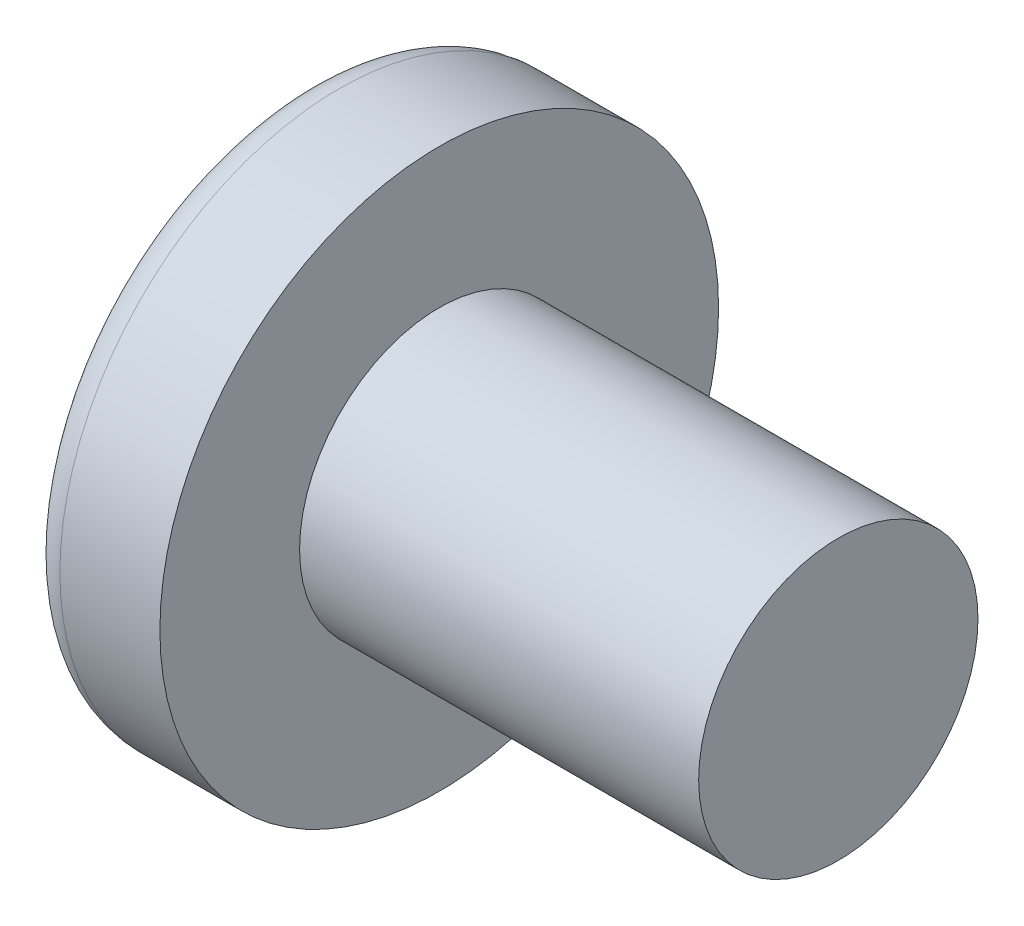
ISO-10303-21;
HEADER;
FILE_DESCRIPTION(('STEP AP214'),'2;1');
FILE_NAME('part.step','',(''),(''),'','','');
FILE_SCHEMA(('AUTOMOTIVE_DESIGN { 1 0 10303 214 1 1 1 1 }'));
ENDSEC;
DATA;
#1=APPLICATION_CONTEXT('core data for automotive mechanical design processes');
#2=APPLICATION_PROTOCOL_DEFINITION('international standard','automotive_design',2000,#1);
#3=PRODUCT_CONTEXT('',#1,'mechanical');
#4=PRODUCT('Part','Part','',(#3));
#5=PRODUCT_RELATED_PRODUCT_CATEGORY('part','',(#4));
#6=PRODUCT_DEFINITION_FORMATION('','',#4);
#7=PRODUCT_DEFINITION_CONTEXT('part definition',#1,'design');
#8=PRODUCT_DEFINITION('design','',#6,#7);
#9=PRODUCT_DEFINITION_SHAPE('','',#8);
#10=(LENGTH_UNIT() NAMED_UNIT(*) SI_UNIT(.MILLI.,.METRE.));
#11=(NAMED_UNIT(*) PLANE_ANGLE_UNIT() SI_UNIT($,.RADIAN.));
#12=(NAMED_UNIT(*) SI_UNIT($,.STERADIAN.) SOLID_ANGLE_UNIT());
#13=UNCERTAINTY_MEASURE_WITH_UNIT(LENGTH_MEASURE(1.E-05),#10,'distance_accuracy_value','');
#14=(GEOMETRIC_REPRESENTATION_CONTEXT(3) GLOBAL_UNCERTAINTY_ASSIGNED_CONTEXT((#13)) GLOBAL_UNIT_ASSIGNED_CONTEXT((#10,
#11,#12)) REPRESENTATION_CONTEXT('',''));
#15=CARTESIAN_POINT('',(0.,0.,0.));
#16=DIRECTION('',(0.,0.,1.));
#17=DIRECTION('',(1.,0.,0.));
#18=AXIS2_PLACEMENT_3D('',#15,#16,#17);
#19=CARTESIAN_POINT('',(6.,0.,0.));
#20=DIRECTION('',(-1.,0.,0.));
#21=DIRECTION('',(0.,1.,0.));
#22=AXIS2_PLACEMENT_3D('',#19,#20,#21);
#23=SPHERICAL_SURFACE('',#22,6.);
#24=CARTESIAN_POINT('',(0.996821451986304,0.,0.));
#25=DIRECTION('',(-1.,0.,0.));
#26=DIRECTION('',(0.,0.,1.));
#27=AXIS2_PLACEMENT_3D('',#24,#25,#26);
#28=CIRCLE('',#27,3.31182795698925);
#29=CARTESIAN_POINT('',(0.996821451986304,0.,3.31182795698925));
#30=VERTEX_POINT('',#29);
#31=EDGE_CURVE('E149',#30,#30,#28,.T.);
#32=ORIENTED_EDGE('',*,*,#31,.T.);
#33=EDGE_LOOP('',(#32));
#34=FACE_BOUND('',#33,.T.);
#35=CARTESIAN_POINT('',(5.97419529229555,-0.231352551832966,0.));
#36=DIRECTION('',(-0.110851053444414,-0.993837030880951,0.));
#37=DIRECTION('',(0.993837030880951,-0.110851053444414,0.));
#38=AXIS2_PLACEMENT_3D('',#35,#36,#37);
#39=CIRCLE('',#38,5.99548247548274);
#40=CARTESIAN_POINT('',(0.266641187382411,0.405259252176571,1.72173216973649));
#41=VERTEX_POINT('',#40);
#42=CARTESIAN_POINT('',(0.0311169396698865,0.431529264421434,0.431529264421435));
#43=VERTEX_POINT('',#42);
#44=EDGE_CURVE('E124',#41,#43,#39,.T.);
#45=ORIENTED_EDGE('',*,*,#44,.F.);
#46=CARTESIAN_POINT('',(4.30993859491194,0.,-1.8913169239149));
#47=DIRECTION('',(0.666319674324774,0.,0.74566620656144));
#48=DIRECTION('',(0.74566620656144,0.,-0.666319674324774));
#49=AXIS2_PLACEMENT_3D('',#46,#47,#48);
#50=CIRCLE('',#49,5.43751898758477);
#51=CARTESIAN_POINT('',(0.266641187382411,-0.405259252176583,1.72173216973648));
#52=VERTEX_POINT('',#51);
#53=EDGE_CURVE('E117',#41,#52,#50,.T.);
#54=ORIENTED_EDGE('',*,*,#53,.T.);
#55=CARTESIAN_POINT('',(5.97419529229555,0.231352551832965,0.));
#56=DIRECTION('',(-0.110851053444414,0.993837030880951,0.));
#57=DIRECTION('',(-0.993837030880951,-0.110851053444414,0.));
#58=AXIS2_PLACEMENT_3D('',#55,#56,#57);
#59=CIRCLE('',#58,5.99548247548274);
#60=CARTESIAN_POINT('',(0.0311169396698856,-0.431529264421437,0.431529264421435));
#61=VERTEX_POINT('',#60);
#62=EDGE_CURVE('E190',#61,#52,#59,.T.);
#63=ORIENTED_EDGE('',*,*,#62,.F.);
#64=CARTESIAN_POINT('',(5.97419529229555,0.,-0.231352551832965));
#65=DIRECTION('',(-0.110851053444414,0.,-0.993837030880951));
#66=DIRECTION('',(-0.993837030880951,0.,0.110851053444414));
#67=AXIS2_PLACEMENT_3D('',#64,#65,#66);
#68=CIRCLE('',#67,5.99548247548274);
#69=CARTESIAN_POINT('',(0.266641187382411,-1.72173216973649,0.405259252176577));
#70=VERTEX_POINT('',#69);
#71=EDGE_CURVE('E165',#70,#61,#68,.T.);
#72=ORIENTED_EDGE('',*,*,#71,.F.);
#73=CARTESIAN_POINT('',(4.30993859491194,1.8913169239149,0.));
#74=DIRECTION('',(0.666319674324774,-0.74566620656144,0.));
#75=DIRECTION('',(0.74566620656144,0.666319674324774,0.));
#76=AXIS2_PLACEMENT_3D('',#73,#74,#75);
#77=CIRCLE('',#76,5.43751898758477);
#78=CARTESIAN_POINT('',(0.266641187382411,-1.72173216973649,-0.405259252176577));
#79=VERTEX_POINT('',#78);
#80=EDGE_CURVE('E161',#70,#79,#77,.T.);
#81=ORIENTED_EDGE('',*,*,#80,.T.);
#82=CARTESIAN_POINT('',(5.97419529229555,0.,0.231352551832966));
#83=DIRECTION('',(-0.110851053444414,0.,0.993837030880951));
#84=DIRECTION('',(0.993837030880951,0.,0.110851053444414));
#85=AXIS2_PLACEMENT_3D('',#82,#83,#84);
#86=CIRCLE('',#85,5.99548247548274);
#87=CARTESIAN_POINT('',(0.0311169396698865,-0.431529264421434,-0.431529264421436));
#88=VERTEX_POINT('',#87);
#89=EDGE_CURVE('E45',#88,#79,#86,.T.);
#90=ORIENTED_EDGE('',*,*,#89,.F.);
#91=CARTESIAN_POINT('',(0.266641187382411,-0.405259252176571,-1.72173216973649));
#92=VERTEX_POINT('',#91);
#93=EDGE_CURVE('E187',#92,#88,#59,.T.);
#94=ORIENTED_EDGE('',*,*,#93,.F.);
#95=CARTESIAN_POINT('',(4.30993859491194,0.,1.8913169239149));
#96=DIRECTION('',(0.666319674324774,0.,-0.74566620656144));
#97=DIRECTION('',(-0.74566620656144,0.,-0.666319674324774));
#98=AXIS2_PLACEMENT_3D('',#95,#96,#97);
#99=CIRCLE('',#98,5.43751898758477);
#100=CARTESIAN_POINT('',(0.266641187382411,0.405259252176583,-1.72173216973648));
#101=VERTEX_POINT('',#100);
#102=EDGE_CURVE('E180',#92,#101,#99,.T.);
#103=ORIENTED_EDGE('',*,*,#102,.T.);
#104=CARTESIAN_POINT('',(0.0311169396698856,0.431529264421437,-0.431529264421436));
#105=VERTEX_POINT('',#104);
#106=EDGE_CURVE('E102',#105,#101,#39,.T.);
#107=ORIENTED_EDGE('',*,*,#106,.F.);
#108=CARTESIAN_POINT('',(0.266641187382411,1.72173216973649,-0.405259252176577));
#109=VERTEX_POINT('',#108);
#110=EDGE_CURVE('E38',#109,#105,#86,.T.);
#111=ORIENTED_EDGE('',*,*,#110,.F.);
#112=CARTESIAN_POINT('',(4.30993859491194,-1.8913169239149,0.));
#113=DIRECTION('',(0.666319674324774,0.74566620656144,0.));
#114=DIRECTION('',(-0.74566620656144,0.666319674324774,0.));
#115=AXIS2_PLACEMENT_3D('',#112,#113,#114);
#116=CIRCLE('',#115,5.43751898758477);
#117=CARTESIAN_POINT('',(0.266641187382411,1.72173216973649,0.405259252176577));
#118=VERTEX_POINT('',#117);
#119=EDGE_CURVE('E11',#109,#118,#116,.T.);
#120=ORIENTED_EDGE('',*,*,#119,.T.);
#121=EDGE_CURVE('E164',#43,#118,#68,.T.);
#122=ORIENTED_EDGE('',*,*,#121,.F.);
#123=EDGE_LOOP('',(#45,#54,#63,#72,#81,#90,#94,#103,#107,#111,#120,#122));
#124=FACE_BOUND('',#123,.T.);
#125=ADVANCED_FACE('F30',(#34,#124),#23,.T.);
#126=CARTESIAN_POINT('',(2.19340028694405,0.,-0.190351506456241));
#127=DIRECTION('',(-0.110851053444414,0.,0.993837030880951));
#128=DIRECTION('',(0.993837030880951,0.,0.110851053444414));
#129=AXIS2_PLACEMENT_3D('',#126,#127,#128);
#130=PLANE('',#129);
#131=ORIENTED_EDGE('',*,*,#110,.T.);
#132=DIRECTION('',(0.987786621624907,-0.110176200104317,0.110176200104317));
#133=VECTOR('',#132,1.);
#134=CARTESIAN_POINT('',(2.21411635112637,0.188040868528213,-0.188040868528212));
#135=LINE('',#134,#133);
#136=CARTESIAN_POINT('',(1.95,0.217500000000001,-0.217499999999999));
#137=VERTEX_POINT('',#136);
#138=EDGE_CURVE('E100',#105,#137,#135,.T.);
#139=ORIENTED_EDGE('',*,*,#138,.T.);
#140=DIRECTION('',(0.743100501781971,-0.664026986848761,0.0828842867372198));
#141=VECTOR('',#140,1.);
#142=CARTESIAN_POINT('',(0.,1.96,-0.435));
#143=LINE('',#142,#141);
#144=EDGE_CURVE('E122',#109,#137,#143,.T.);
#145=ORIENTED_EDGE('',*,*,#144,.F.);
#146=EDGE_LOOP('',(#131,#139,#145));
#147=FACE_BOUND('',#146,.T.);
#148=ADVANCED_FACE('F121',(#147),#130,.T.);
#149=DIRECTION('',(0.743100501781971,0.664026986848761,0.0828842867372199));
#150=VECTOR('',#149,1.);
#151=CARTESIAN_POINT('',(0.,-1.96,-0.435));
#152=LINE('',#151,#150);
#153=CARTESIAN_POINT('',(1.95,-0.2175,-0.2175));
#154=VERTEX_POINT('',#153);
#155=EDGE_CURVE('E143',#79,#154,#152,.T.);
#156=ORIENTED_EDGE('',*,*,#155,.T.);
#157=DIRECTION('',(-0.987786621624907,-0.110176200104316,-0.110176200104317));
#158=VECTOR('',#157,1.);
#159=CARTESIAN_POINT('',(2.21411635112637,-0.188040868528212,-0.188040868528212));
#160=LINE('',#159,#158);
#161=EDGE_CURVE('E188',#154,#88,#160,.T.);
#162=ORIENTED_EDGE('',*,*,#161,.T.);
#163=ORIENTED_EDGE('',*,*,#89,.T.);
#164=EDGE_LOOP('',(#156,#162,#163));
#165=FACE_BOUND('',#164,.T.);
#166=ADVANCED_FACE('F221',(#165),#130,.T.);
#167=CARTESIAN_POINT('',(2.19340028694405,0.,0.190351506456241));
#168=DIRECTION('',(-0.110851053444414,0.,-0.993837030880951));
#169=DIRECTION('',(-0.993837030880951,0.,0.110851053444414));
#170=AXIS2_PLACEMENT_3D('',#167,#168,#169);
#171=PLANE('',#170);
#172=DIRECTION('',(0.743100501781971,-0.664026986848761,-0.0828842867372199));
#173=VECTOR('',#172,1.);
#174=CARTESIAN_POINT('',(0.,1.96,0.435));
#175=LINE('',#174,#173);
#176=CARTESIAN_POINT('',(1.95,0.2175,0.2175));
#177=VERTEX_POINT('',#176);
#178=EDGE_CURVE('E129',#118,#177,#175,.T.);
#179=ORIENTED_EDGE('',*,*,#178,.T.);
#180=DIRECTION('',(-0.987786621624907,0.110176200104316,0.110176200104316));
#181=VECTOR('',#180,1.);
#182=CARTESIAN_POINT('',(2.21411635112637,0.188040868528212,0.188040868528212));
#183=LINE('',#182,#181);
#184=EDGE_CURVE('E176',#177,#43,#183,.T.);
#185=ORIENTED_EDGE('',*,*,#184,.T.);
#186=ORIENTED_EDGE('',*,*,#121,.T.);
#187=EDGE_LOOP('',(#179,#185,#186));
#188=FACE_BOUND('',#187,.T.);
#189=ADVANCED_FACE('F174',(#188),#171,.T.);
#190=ORIENTED_EDGE('',*,*,#71,.T.);
#191=DIRECTION('',(0.987786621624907,0.110176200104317,-0.110176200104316));
#192=VECTOR('',#191,1.);
#193=CARTESIAN_POINT('',(2.21411635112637,-0.188040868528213,0.188040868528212));
#194=LINE('',#193,#192);
#195=CARTESIAN_POINT('',(1.95,-0.217500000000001,0.217499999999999));
#196=VERTEX_POINT('',#195);
#197=EDGE_CURVE('E193',#61,#196,#194,.T.);
#198=ORIENTED_EDGE('',*,*,#197,.T.);
#199=DIRECTION('',(0.743100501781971,0.664026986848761,-0.0828842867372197));
#200=VECTOR('',#199,1.);
#201=CARTESIAN_POINT('',(0.,-1.96,0.434999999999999));
#202=LINE('',#201,#200);
#203=EDGE_CURVE('E140',#70,#196,#202,.T.);
#204=ORIENTED_EDGE('',*,*,#203,.F.);
#205=EDGE_LOOP('',(#190,#198,#204));
#206=FACE_BOUND('',#205,.T.);
#207=ADVANCED_FACE('F240',(#206),#171,.T.);
#208=CARTESIAN_POINT('',(-25.4,0.,0.));
#209=DIRECTION('',(-1.,0.,0.));
#210=DIRECTION('',(0.,0.,1.));
#211=AXIS2_PLACEMENT_3D('',#208,#209,#210);
#212=CYLINDRICAL_SURFACE('',#211,1.75);
#213=CARTESIAN_POINT('',(7.6,0.,0.));
#214=DIRECTION('',(-1.,0.,0.));
#215=DIRECTION('',(0.,0.,1.));
#216=AXIS2_PLACEMENT_3D('',#213,#214,#215);
#217=CIRCLE('',#216,1.75);
#218=CARTESIAN_POINT('',(7.6,0.,1.75));
#219=VERTEX_POINT('',#218);
#220=EDGE_CURVE('E128',#219,#219,#217,.T.);
#221=ORIENTED_EDGE('',*,*,#220,.T.);
#222=EDGE_LOOP('',(#221));
#223=FACE_BOUND('',#222,.T.);
#224=CARTESIAN_POINT('',(2.6,0.,0.));
#225=DIRECTION('',(-1.,0.,0.));
#226=DIRECTION('',(0.,0.,1.));
#227=AXIS2_PLACEMENT_3D('',#224,#225,#226);
#228=CIRCLE('',#227,1.75);
#229=CARTESIAN_POINT('',(2.6,0.,1.75));
#230=VERTEX_POINT('',#229);
#231=EDGE_CURVE('E158',#230,#230,#228,.T.);
#232=ORIENTED_EDGE('',*,*,#231,.F.);
#233=EDGE_LOOP('',(#232));
#234=FACE_BOUND('',#233,.T.);
#235=ADVANCED_FACE('F32',(#223,#234),#212,.T.);
#236=CARTESIAN_POINT('',(2.6,1.75,0.));
#237=DIRECTION('',(-1.,0.,0.));
#238=DIRECTION('',(0.,0.,1.));
#239=AXIS2_PLACEMENT_3D('',#236,#237,#238);
#240=PLANE('',#239);
#241=CARTESIAN_POINT('',(2.6,0.,0.));
#242=DIRECTION('',(-1.,0.,0.));
#243=DIRECTION('',(0.,0.,1.));
#244=AXIS2_PLACEMENT_3D('',#241,#242,#243);
#245=CIRCLE('',#244,3.5);
#246=CARTESIAN_POINT('',(2.6,0.,3.5));
#247=VERTEX_POINT('',#246);
#248=EDGE_CURVE('E155',#247,#247,#245,.T.);
#249=ORIENTED_EDGE('',*,*,#248,.F.);
#250=EDGE_LOOP('',(#249));
#251=FACE_BOUND('',#250,.T.);
#252=ORIENTED_EDGE('',*,*,#231,.T.);
#253=EDGE_LOOP('',(#252));
#254=FACE_BOUND('',#253,.T.);
#255=ADVANCED_FACE('F233',(#251,#254),#240,.F.);
#256=CARTESIAN_POINT('',(-25.4,0.,0.));
#257=DIRECTION('',(-1.,0.,0.));
#258=DIRECTION('',(0.,0.,1.));
#259=AXIS2_PLACEMENT_3D('',#256,#257,#258);
#260=CYLINDRICAL_SURFACE('',#259,3.5);
#261=ORIENTED_EDGE('',*,*,#248,.T.);
#262=EDGE_LOOP('',(#261));
#263=FACE_BOUND('',#262,.T.);
#264=CARTESIAN_POINT('',(1.34704395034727,0.,0.));
#265=DIRECTION('',(-1.,0.,0.));
#266=DIRECTION('',(0.,0.,1.));
#267=AXIS2_PLACEMENT_3D('',#264,#265,#266);
#268=CIRCLE('',#267,3.5);
#269=CARTESIAN_POINT('',(1.34704395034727,0.,3.5));
#270=VERTEX_POINT('',#269);
#271=EDGE_CURVE('E152',#270,#270,#268,.T.);
#272=ORIENTED_EDGE('',*,*,#271,.F.);
#273=EDGE_LOOP('',(#272));
#274=FACE_BOUND('',#273,.T.);
#275=ADVANCED_FACE('F230',(#263,#274),#260,.T.);
#276=CARTESIAN_POINT('',(1.34704395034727,0.,0.));
#277=DIRECTION('',(-1.,0.,0.));
#278=DIRECTION('',(0.,0.,1.));
#279=AXIS2_PLACEMENT_3D('',#276,#277,#278);
#280=TOROIDAL_SURFACE('',#279,3.08,0.42);
#281=ORIENTED_EDGE('',*,*,#271,.T.);
#282=EDGE_LOOP('',(#281));
#283=FACE_BOUND('',#282,.T.);
#284=ORIENTED_EDGE('',*,*,#31,.F.);
#285=EDGE_LOOP('',(#284));
#286=FACE_BOUND('',#285,.T.);
#287=ADVANCED_FACE('F227',(#283,#286),#280,.T.);
#288=CARTESIAN_POINT('',(7.6,1.75,0.));
#289=DIRECTION('',(1.,0.,0.));
#290=DIRECTION('',(0.,0.,-1.));
#291=AXIS2_PLACEMENT_3D('',#288,#289,#290);
#292=PLANE('',#291);
#293=ORIENTED_EDGE('',*,*,#220,.F.);
#294=EDGE_LOOP('',(#293));
#295=FACE_BOUND('',#294,.T.);
#296=ADVANCED_FACE('F225',(#295),#292,.T.);
#297=CARTESIAN_POINT('',(1.95,0.2175,0.2175));
#298=DIRECTION('',(0.666319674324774,0.74566620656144,0.));
#299=DIRECTION('',(-0.74566620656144,0.666319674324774,0.));
#300=AXIS2_PLACEMENT_3D('',#297,#298,#299);
#301=PLANE('',#300);
#302=ORIENTED_EDGE('',*,*,#144,.T.);
#303=DIRECTION('',(0.,0.,-1.));
#304=VECTOR('',#303,1.);
#305=CARTESIAN_POINT('',(1.95,0.2175,0.2175));
#306=LINE('',#305,#304);
#307=EDGE_CURVE('E116',#177,#137,#306,.T.);
#308=ORIENTED_EDGE('',*,*,#307,.F.);
#309=ORIENTED_EDGE('',*,*,#178,.F.);
#310=ORIENTED_EDGE('',*,*,#119,.F.);
#311=EDGE_LOOP('',(#302,#308,#309,#310));
#312=FACE_BOUND('',#311,.T.);
#313=ADVANCED_FACE('F127',(#312),#301,.F.);
#314=CARTESIAN_POINT('',(1.95,-0.2175,-0.2175));
#315=DIRECTION('',(0.666319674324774,-0.74566620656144,0.));
#316=DIRECTION('',(0.74566620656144,0.666319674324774,0.));
#317=AXIS2_PLACEMENT_3D('',#314,#315,#316);
#318=PLANE('',#317);
#319=ORIENTED_EDGE('',*,*,#203,.T.);
#320=DIRECTION('',(0.,0.,1.));
#321=VECTOR('',#320,1.);
#322=CARTESIAN_POINT('',(1.95,-0.2175,-0.2175));
#323=LINE('',#322,#321);
#324=EDGE_CURVE('E136',#154,#196,#323,.T.);
#325=ORIENTED_EDGE('',*,*,#324,.F.);
#326=ORIENTED_EDGE('',*,*,#155,.F.);
#327=ORIENTED_EDGE('',*,*,#80,.F.);
#328=EDGE_LOOP('',(#319,#325,#326,#327));
#329=FACE_BOUND('',#328,.T.);
#330=ADVANCED_FACE('F260',(#329),#318,.F.);
#331=CARTESIAN_POINT('',(1.95,0.2175,-0.2175));
#332=DIRECTION('',(-1.,0.,0.));
#333=DIRECTION('',(0.,0.,1.));
#334=AXIS2_PLACEMENT_3D('',#331,#332,#333);
#335=PLANE('',#334);
#336=DIRECTION('',(0.,1.,0.));
#337=VECTOR('',#336,1.);
#338=CARTESIAN_POINT('',(1.95,-0.2175,-0.2175));
#339=LINE('',#338,#337);
#340=EDGE_CURVE('E109',#154,#137,#339,.T.);
#341=ORIENTED_EDGE('',*,*,#340,.F.);
#342=ORIENTED_EDGE('',*,*,#324,.T.);
#343=DIRECTION('',(0.,-1.,0.));
#344=VECTOR('',#343,1.);
#345=CARTESIAN_POINT('',(1.95,0.2175,0.2175));
#346=LINE('',#345,#344);
#347=EDGE_CURVE('E134',#177,#196,#346,.T.);
#348=ORIENTED_EDGE('',*,*,#347,.F.);
#349=ORIENTED_EDGE('',*,*,#307,.T.);
#350=EDGE_LOOP('',(#341,#342,#348,#349));
#351=FACE_BOUND('',#350,.T.);
#352=ADVANCED_FACE('F132',(#351),#335,.T.);
#353=CARTESIAN_POINT('',(1.95,0.217500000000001,-0.217499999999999));
#354=DIRECTION('',(0.666319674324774,0.,-0.74566620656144));
#355=DIRECTION('',(0.74566620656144,0.,0.666319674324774));
#356=AXIS2_PLACEMENT_3D('',#353,#354,#355);
#357=PLANE('',#356);
#358=DIRECTION('',(0.743100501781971,0.0828842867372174,0.664026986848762));
#359=VECTOR('',#358,1.);
#360=CARTESIAN_POINT('',(0.,-0.434999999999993,-1.96));
#361=LINE('',#360,#359);
#362=EDGE_CURVE('E106',#92,#154,#361,.T.);
#363=ORIENTED_EDGE('',*,*,#362,.T.);
#364=ORIENTED_EDGE('',*,*,#340,.T.);
#365=DIRECTION('',(0.743100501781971,-0.0828842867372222,0.664026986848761));
#366=VECTOR('',#365,1.);
#367=CARTESIAN_POINT('',(0.,0.435000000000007,-1.96));
#368=LINE('',#367,#366);
#369=EDGE_CURVE('E96',#101,#137,#368,.T.);
#370=ORIENTED_EDGE('',*,*,#369,.F.);
#371=ORIENTED_EDGE('',*,*,#102,.F.);
#372=EDGE_LOOP('',(#363,#364,#370,#371));
#373=FACE_BOUND('',#372,.T.);
#374=ADVANCED_FACE('F110',(#373),#357,.F.);
#375=CARTESIAN_POINT('',(2.19340028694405,-0.190351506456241,0.));
#376=DIRECTION('',(-0.110851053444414,0.993837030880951,0.));
#377=DIRECTION('',(-0.993837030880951,-0.110851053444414,0.));
#378=AXIS2_PLACEMENT_3D('',#375,#376,#377);
#379=PLANE('',#378);
#380=ORIENTED_EDGE('',*,*,#93,.T.);
#381=ORIENTED_EDGE('',*,*,#161,.F.);
#382=ORIENTED_EDGE('',*,*,#362,.F.);
#383=EDGE_LOOP('',(#380,#381,#382));
#384=FACE_BOUND('',#383,.T.);
#385=ADVANCED_FACE('F212',(#384),#379,.T.);
#386=CARTESIAN_POINT('',(2.19340028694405,0.190351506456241,0.));
#387=DIRECTION('',(-0.110851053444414,-0.993837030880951,0.));
#388=DIRECTION('',(0.993837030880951,-0.110851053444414,0.));
#389=AXIS2_PLACEMENT_3D('',#386,#387,#388);
#390=PLANE('',#389);
#391=ORIENTED_EDGE('',*,*,#106,.T.);
#392=ORIENTED_EDGE('',*,*,#369,.T.);
#393=ORIENTED_EDGE('',*,*,#138,.F.);
#394=EDGE_LOOP('',(#391,#392,#393));
#395=FACE_BOUND('',#394,.T.);
#396=ADVANCED_FACE('F98',(#395),#390,.T.);
#397=CARTESIAN_POINT('',(1.95,-0.217500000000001,0.217499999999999));
#398=DIRECTION('',(0.666319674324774,0.,0.74566620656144));
#399=DIRECTION('',(-0.74566620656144,0.,0.666319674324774));
#400=AXIS2_PLACEMENT_3D('',#397,#398,#399);
#401=PLANE('',#400);
#402=DIRECTION('',(0.743100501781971,-0.0828842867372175,-0.664026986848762));
#403=VECTOR('',#402,1.);
#404=CARTESIAN_POINT('',(0.,0.434999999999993,1.96));
#405=LINE('',#404,#403);
#406=EDGE_CURVE('E196',#41,#177,#405,.T.);
#407=ORIENTED_EDGE('',*,*,#406,.T.);
#408=ORIENTED_EDGE('',*,*,#347,.T.);
#409=DIRECTION('',(0.743100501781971,0.0828842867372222,-0.664026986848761));
#410=VECTOR('',#409,1.);
#411=CARTESIAN_POINT('',(0.,-0.435000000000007,1.96));
#412=LINE('',#411,#410);
#413=EDGE_CURVE('E105',#52,#196,#412,.T.);
#414=ORIENTED_EDGE('',*,*,#413,.F.);
#415=ORIENTED_EDGE('',*,*,#53,.F.);
#416=EDGE_LOOP('',(#407,#408,#414,#415));
#417=FACE_BOUND('',#416,.T.);
#418=ADVANCED_FACE('F200',(#417),#401,.F.);
#419=ORIENTED_EDGE('',*,*,#44,.T.);
#420=ORIENTED_EDGE('',*,*,#184,.F.);
#421=ORIENTED_EDGE('',*,*,#406,.F.);
#422=EDGE_LOOP('',(#419,#420,#421));
#423=FACE_BOUND('',#422,.T.);
#424=ADVANCED_FACE('F202',(#423),#390,.T.);
#425=ORIENTED_EDGE('',*,*,#62,.T.);
#426=ORIENTED_EDGE('',*,*,#413,.T.);
#427=ORIENTED_EDGE('',*,*,#197,.F.);
#428=EDGE_LOOP('',(#425,#426,#427));
#429=FACE_BOUND('',#428,.T.);
#430=ADVANCED_FACE('F204',(#429),#379,.T.);
#431=CLOSED_SHELL('',(#125,#148,#166,#189,#207,#235,#255,#275,#287,#296,#313,#330,#352,#374,
#385,#396,#418,#424,#430));
#432=MANIFOLD_SOLID_BREP('B2',#431);
#433=ADVANCED_BREP_SHAPE_REPRESENTATION('',(#18,#432),#14);
#434=SHAPE_DEFINITION_REPRESENTATION(#9,#433);
ENDSEC;
END-ISO-10303-21;
